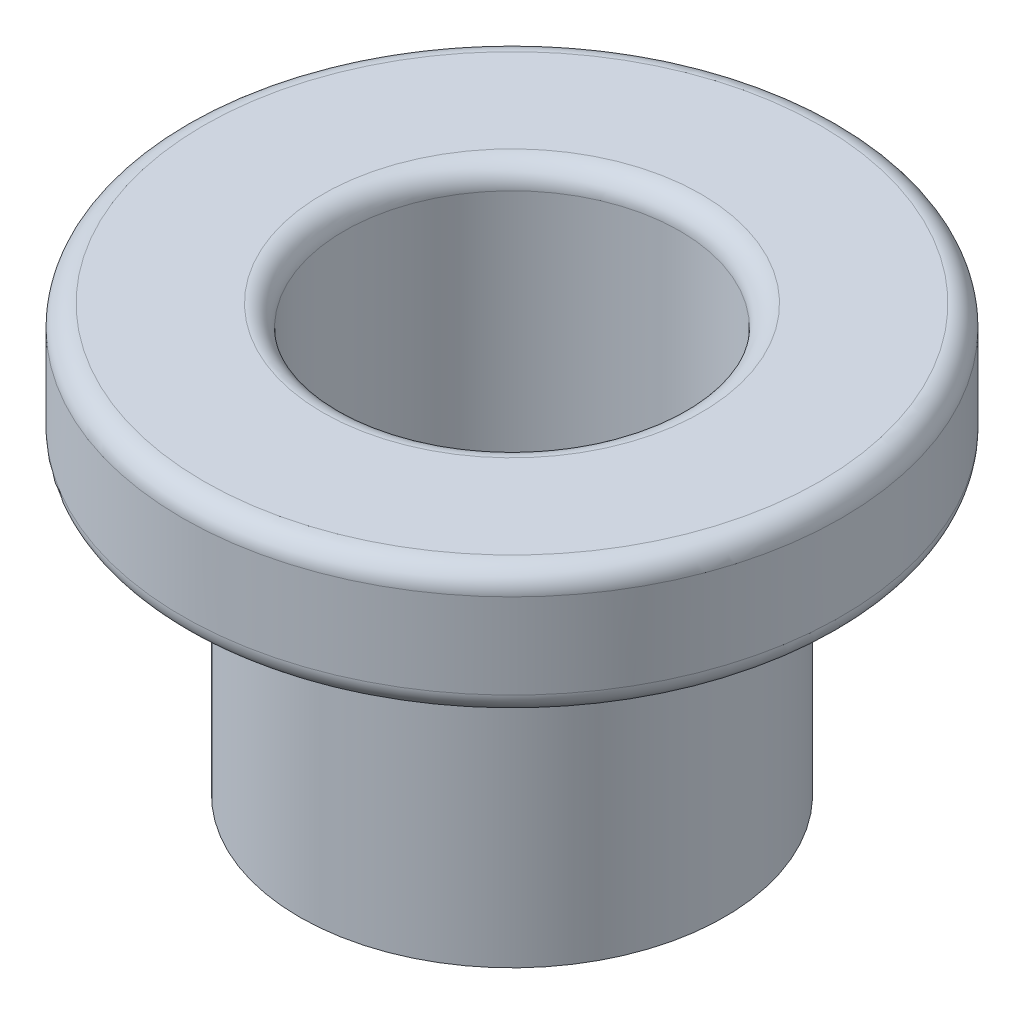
from build123d import *

# Parameters (mm, degrees)
FILLET1_R = 0.254


with BuildPart() as part:
    # Sketch1 → Revolve1 (revolve)
    with BuildSketch(Plane.XY, mode=Mode.PRIVATE) as revolve1_sk:
        Polygon((2.0066, 0), (2.0066, 5.08), (3.937, 5.08), (3.937, 3.556), (2.54, 3.556), (2.54, 0), align=None)
    revolve(revolve1_sk.sketch.rotate(Axis((0, 0, 0), (0, 1, 0)), 90), axis=Axis((0, 0, 0), (0, 1, 0)))

    # Fillet1
    fillet1_edges = [part.edges().sort_by_distance(p)[0] for p in [
        (0, 3.556, 3.937),
        (0, 5.08, 3.937),
        (0, 5.08, 2.0066),
    ]]
    fillet(fillet1_edges, radius=FILLET1_R)


solid = part.part
